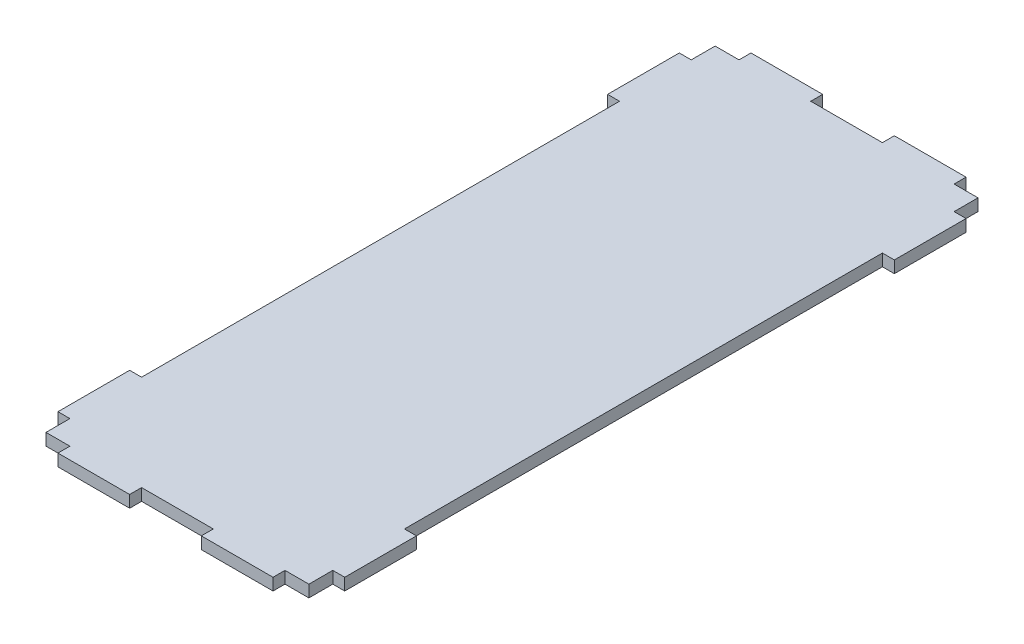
from build123d import *

# Parameters (mm, degrees)
SKETCH1_W           = 69.85
SKETCH1_H           = 177.8
BOSS_EXTRUDE1_DEPTH = 3.175
SKETCH2_W           = 19.05
SKETCH2_H           = 3.175
SKETCH2_W_2         = 3.175
SKETCH2_H_2         = 19.05
BOSS_EXTRUDE2_DEPTH = 3.175


with BuildPart() as part:
    # Sketch1 → Boss-Extrude1 (new body)
    with BuildSketch(Plane(origin=(0, 0, 0), x_dir=(1, 0, 0), z_dir=(0, 1, 0))):
        with Locations((34.925, 88.9)):
            Rectangle(SKETCH1_W, SKETCH1_H)
    extrude(amount=BOSS_EXTRUDE1_DEPTH)

    # Sketch2 → Boss-Extrude2 (add)
    with BuildSketch(Plane(origin=(0, 0, 0), x_dir=(1, 0, 0), z_dir=(0, 1, 0))):
        with Locations((53.975, -1.5875)):
            Rectangle(SKETCH2_W, SKETCH2_H)
        with Locations((15.875, 179.3875)):
            Rectangle(SKETCH2_W, SKETCH2_H)
        with Locations((53.975, 179.3875)):
            Rectangle(SKETCH2_W, SKETCH2_H)
        with Locations((15.875, -1.5875)):
            Rectangle(SKETCH2_W, SKETCH2_H)
        with Locations((-1.5875, 15.875)):
            Rectangle(SKETCH2_W_2, SKETCH2_H_2)
        with Locations((-1.5875, 161.925)):
            Rectangle(SKETCH2_W_2, SKETCH2_H_2)
        with Locations((71.4375, 15.875)):
            Rectangle(SKETCH2_W_2, SKETCH2_H_2)
        with Locations((71.4375, 161.925)):
            Rectangle(SKETCH2_W_2, SKETCH2_H_2)
    extrude(amount=BOSS_EXTRUDE2_DEPTH)


solid = part.part
